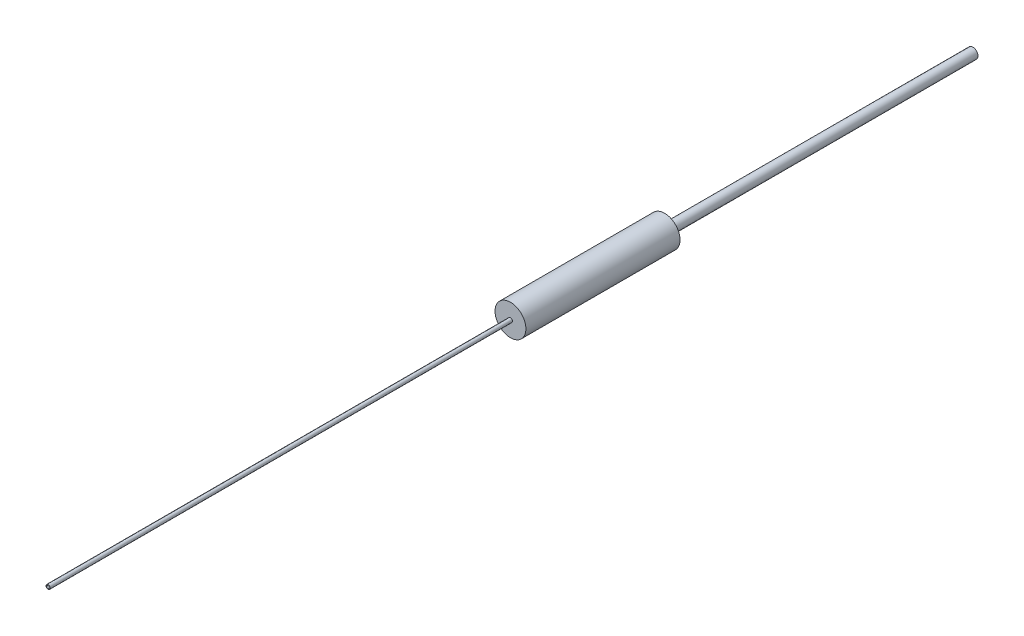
from build123d import *

# Parameters (mm, degrees)
SKETCH_1_R          = 1.5
EXTRUDE_1_DEPTH     = 15
SKETCH_2_R          = 0.2
EXTRUDE_2_DEPTH     = 45
SKETCH_3_R          = 0.5
EXTRUDE_3_DEPTH     = 30
SKETCH_4_R          = 0.1375
SKETCH_4_R_2        = 0.1325
CUT_EXTRUDE_1_DEPTH = 0.1


with BuildPart() as part:
    # Sketch 1 → Extrude 1 (new body)
    with BuildSketch(Plane.XY):
        Circle(SKETCH_1_R)
    extrude(amount=-EXTRUDE_1_DEPTH)

    # Sketch 2 → Extrude 2 (add)
    with BuildSketch(Plane.XY):
        Circle(SKETCH_2_R)
    extrude(amount=EXTRUDE_2_DEPTH)

    # Sketch 3 → Extrude 3 (add)
    with BuildSketch(Plane(origin=(0, 0, -15), x_dir=(-1, 0, 0), z_dir=(0, 0, -1))):
        Circle(SKETCH_3_R)
    extrude(amount=EXTRUDE_3_DEPTH)

    # Sketch 4 → Cut-Extrude 1 (cut)
    with BuildSketch(Plane.XY.offset(45)):
        Circle(SKETCH_4_R)
        Circle(SKETCH_4_R_2, mode=Mode.SUBTRACT)
    extrude(amount=-CUT_EXTRUDE_1_DEPTH, mode=Mode.SUBTRACT)


solid = part.part
